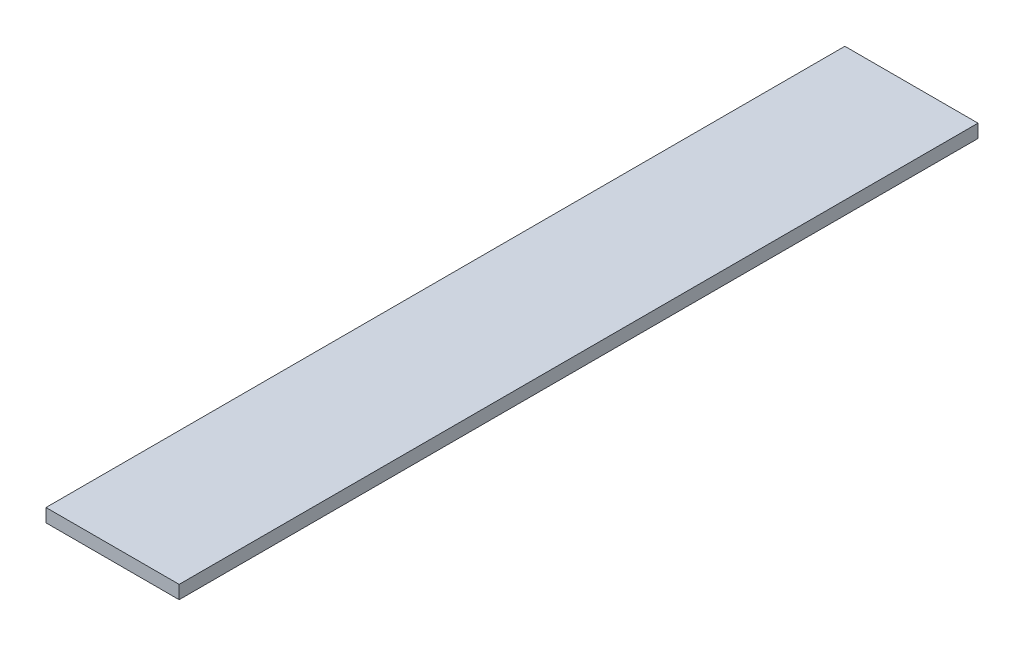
from build123d import *

# Parameters (mm, degrees)
ESQUISSE1_W          = 50
ESQUISSE1_H          = 5
BASE_EXTRUSION_DEPTH = 300


with BuildPart() as part:
    # Esquisse1 → Base-Extrusion (new body)
    with BuildSketch(Plane.XY):
        with Locations((25, -2.5)):
            Rectangle(ESQUISSE1_W, ESQUISSE1_H)
    extrude(amount=BASE_EXTRUSION_DEPTH)


solid = part.part
